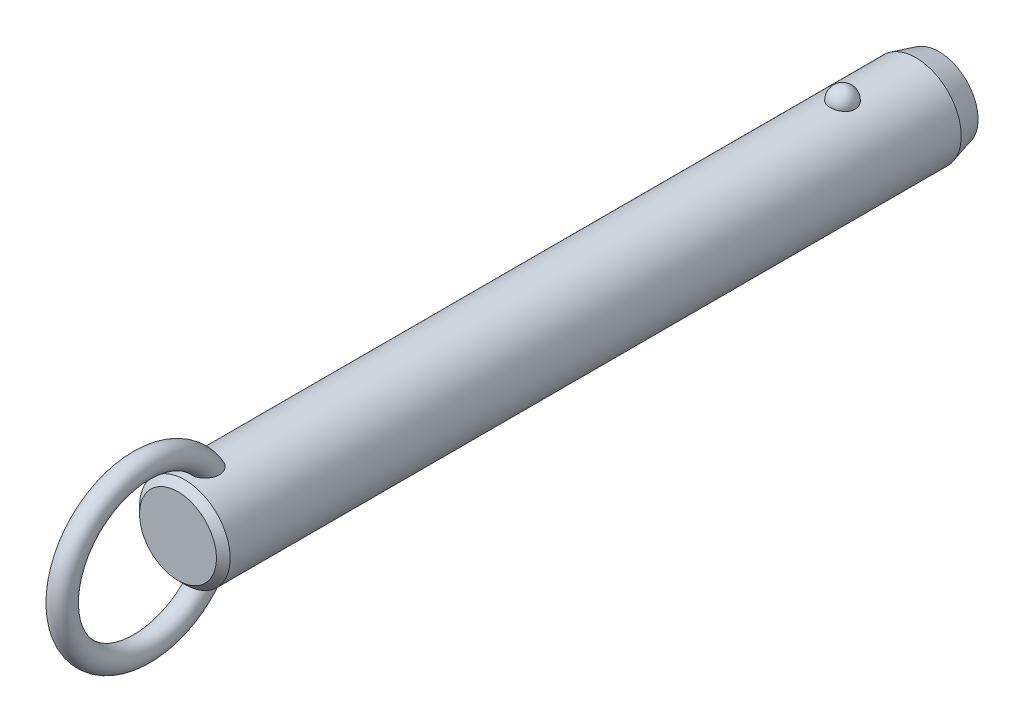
ISO-10303-21;
HEADER;
FILE_DESCRIPTION(('STEP AP214'),'2;1');
FILE_NAME('part.step','',(''),(''),'','','');
FILE_SCHEMA(('AUTOMOTIVE_DESIGN { 1 0 10303 214 1 1 1 1 }'));
ENDSEC;
DATA;
#1=APPLICATION_CONTEXT('core data for automotive mechanical design processes');
#2=APPLICATION_PROTOCOL_DEFINITION('international standard','automotive_design',2000,#1);
#3=PRODUCT_CONTEXT('',#1,'mechanical');
#4=PRODUCT('Part','Part','',(#3));
#5=PRODUCT_RELATED_PRODUCT_CATEGORY('part','',(#4));
#6=PRODUCT_DEFINITION_FORMATION('','',#4);
#7=PRODUCT_DEFINITION_CONTEXT('part definition',#1,'design');
#8=PRODUCT_DEFINITION('design','',#6,#7);
#9=PRODUCT_DEFINITION_SHAPE('','',#8);
#10=(LENGTH_UNIT() NAMED_UNIT(*) SI_UNIT(.MILLI.,.METRE.));
#11=(NAMED_UNIT(*) PLANE_ANGLE_UNIT() SI_UNIT($,.RADIAN.));
#12=(NAMED_UNIT(*) SI_UNIT($,.STERADIAN.) SOLID_ANGLE_UNIT());
#13=UNCERTAINTY_MEASURE_WITH_UNIT(LENGTH_MEASURE(1.E-05),#10,'distance_accuracy_value','');
#14=(GEOMETRIC_REPRESENTATION_CONTEXT(3) GLOBAL_UNCERTAINTY_ASSIGNED_CONTEXT((#13)) GLOBAL_UNIT_ASSIGNED_CONTEXT((#10,
#11,#12)) REPRESENTATION_CONTEXT('',''));
#15=CARTESIAN_POINT('',(0.,0.,0.));
#16=DIRECTION('',(0.,0.,1.));
#17=DIRECTION('',(1.,0.,0.));
#18=AXIS2_PLACEMENT_3D('',#15,#16,#17);
#19=CARTESIAN_POINT('',(0.,0.,104.1));
#20=DIRECTION('',(0.,0.,-1.));
#21=DIRECTION('',(-1.,0.,0.));
#22=AXIS2_PLACEMENT_3D('',#19,#20,#21);
#23=CYLINDRICAL_SURFACE('',#22,7.9);
#24=CARTESIAN_POINT('',(2.1785689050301,7.59367088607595,-2.19999999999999));
#25=CARTESIAN_POINT('',(2.17856679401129,7.59367269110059,-2.07701843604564));
#26=CARTESIAN_POINT('',(2.16853481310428,7.59657145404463,-1.95401006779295));
#27=CARTESIAN_POINT('',(2.12864689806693,7.607843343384,-1.71147811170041));
#28=CARTESIAN_POINT('',(2.09878338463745,7.61621856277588,-1.59195587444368));
#29=CARTESIAN_POINT('',(2.0199931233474,7.63749180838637,-1.3598563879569));
#30=CARTESIAN_POINT('',(1.97107475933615,7.6503878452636,-1.24727610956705));
#31=CARTESIAN_POINT('',(1.85539377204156,7.67926115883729,-1.03213234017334));
#32=CARTESIAN_POINT('',(1.78863158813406,7.69523835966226,-0.929568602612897));
#33=CARTESIAN_POINT('',(1.63856494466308,7.7285848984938,-0.736786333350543));
#34=CARTESIAN_POINT('',(1.55518140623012,7.7459606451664,-0.646630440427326));
#35=CARTESIAN_POINT('',(1.37422937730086,7.78009978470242,-0.481747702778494));
#36=CARTESIAN_POINT('',(1.27666086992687,7.79686317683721,-0.407020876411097));
#37=CARTESIAN_POINT('',(1.07024728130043,7.82786153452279,-0.275278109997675));
#38=CARTESIAN_POINT('',(0.961434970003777,7.84210353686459,-0.218212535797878));
#39=CARTESIAN_POINT('',(0.735351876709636,7.86652194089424,-0.123146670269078));
#40=CARTESIAN_POINT('',(0.618082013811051,7.87669878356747,-0.085144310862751));
#41=CARTESIAN_POINT('',(0.380637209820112,7.89170521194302,-0.0298158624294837));
#42=CARTESIAN_POINT('',(0.260550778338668,7.89662650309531,-0.0121347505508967));
#43=CARTESIAN_POINT('',(0.0190117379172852,7.90090003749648,0.00324379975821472));
#44=CARTESIAN_POINT('',(-0.102440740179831,7.90025280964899,0.00094313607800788));
#45=CARTESIAN_POINT('',(-0.341452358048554,7.89351056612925,-0.0233955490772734));
#46=CARTESIAN_POINT('',(-0.459042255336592,7.88749257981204,-0.0451545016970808));
#47=CARTESIAN_POINT('',(-0.688796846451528,7.87075812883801,-0.107408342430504));
#48=CARTESIAN_POINT('',(-0.800961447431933,7.86004158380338,-0.147903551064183));
#49=CARTESIAN_POINT('',(-1.01743634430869,7.83497131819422,-0.246799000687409));
#50=CARTESIAN_POINT('',(-1.12169791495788,7.82059709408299,-0.305300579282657));
#51=CARTESIAN_POINT('',(-1.31891765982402,7.78976470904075,-0.438549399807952));
#52=CARTESIAN_POINT('',(-1.41187469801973,7.77330633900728,-0.513298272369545));
#53=CARTESIAN_POINT('',(-1.58577142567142,7.73972434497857,-0.678622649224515));
#54=CARTESIAN_POINT('',(-1.66645140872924,7.72259402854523,-0.769470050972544));
#55=CARTESIAN_POINT('',(-1.81161503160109,7.68983776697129,-0.963538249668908));
#56=CARTESIAN_POINT('',(-1.87609753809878,7.6742119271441,-1.06675991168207));
#57=CARTESIAN_POINT('',(-1.98790138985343,7.6460202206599,-1.28401170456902));
#58=CARTESIAN_POINT('',(-2.03501994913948,7.63349104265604,-1.39815107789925));
#59=CARTESIAN_POINT('',(-2.10986724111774,7.6131449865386,-1.63301784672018));
#60=CARTESIAN_POINT('',(-2.1375965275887,7.60532797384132,-1.75374505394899));
#61=CARTESIAN_POINT('',(-2.17289256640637,7.5953195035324,-1.99782562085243));
#62=CARTESIAN_POINT('',(-2.18054294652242,7.59310471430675,-2.12116592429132));
#63=CARTESIAN_POINT('',(-2.17572919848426,7.59448538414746,-2.36741799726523));
#64=CARTESIAN_POINT('',(-2.1632656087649,7.59808068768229,-2.49032977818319));
#65=CARTESIAN_POINT('',(-2.11865035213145,7.61064035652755,-2.73161015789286));
#66=CARTESIAN_POINT('',(-2.08659579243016,7.61957823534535,-2.84999812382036));
#67=CARTESIAN_POINT('',(-2.00367799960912,7.64179982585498,-3.07955956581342));
#68=CARTESIAN_POINT('',(-1.9528140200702,7.65508371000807,-3.19073275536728));
#69=CARTESIAN_POINT('',(-1.83321113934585,7.68460381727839,-3.40337899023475));
#70=CARTESIAN_POINT('',(-1.76437735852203,7.70085556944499,-3.50479651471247));
#71=CARTESIAN_POINT('',(-1.61069526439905,7.73445734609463,-3.69446912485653));
#72=CARTESIAN_POINT('',(-1.52584634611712,7.75180741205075,-3.78272371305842));
#73=CARTESIAN_POINT('',(-1.34198059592,7.78574608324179,-3.94393987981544));
#74=CARTESIAN_POINT('',(-1.24291308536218,7.80233167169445,-4.01684434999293));
#75=CARTESIAN_POINT('',(-1.03352039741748,7.83281625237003,-4.14489386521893));
#76=CARTESIAN_POINT('',(-0.92319600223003,7.84671543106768,-4.20004014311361));
#77=CARTESIAN_POINT('',(-0.695822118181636,7.87011575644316,-4.29042017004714));
#78=CARTESIAN_POINT('',(-0.578872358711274,7.87966903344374,-4.32589112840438));
#79=CARTESIAN_POINT('',(-0.340410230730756,7.8935652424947,-4.37692226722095));
#80=CARTESIAN_POINT('',(-0.218898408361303,7.89790879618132,-4.39248482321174));
#81=CARTESIAN_POINT('',(0.0228107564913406,7.90087453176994,-4.40314405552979));
#82=CARTESIAN_POINT('',(0.142990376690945,7.89960185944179,-4.39861683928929));
#83=CARTESIAN_POINT('',(0.380829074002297,7.89171262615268,-4.37008293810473));
#84=CARTESIAN_POINT('',(0.498488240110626,7.8850962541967,-4.34607694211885));
#85=CARTESIAN_POINT('',(0.727535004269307,7.86726442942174,-4.27939317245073));
#86=CARTESIAN_POINT('',(0.838944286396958,7.85606616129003,-4.236785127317));
#87=CARTESIAN_POINT('',(1.05295421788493,7.83025654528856,-4.13408348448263));
#88=CARTESIAN_POINT('',(1.15555431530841,7.81564498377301,-4.07398879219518));
#89=CARTESIAN_POINT('',(1.35076763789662,7.7843022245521,-3.93687432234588));
#90=CARTESIAN_POINT('',(1.4432046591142,7.76754209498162,-3.85961036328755));
#91=CARTESIAN_POINT('',(1.6139111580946,7.73387857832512,-3.69076949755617));
#92=CARTESIAN_POINT('',(1.6921781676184,7.71697516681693,-3.59919010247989));
#93=CARTESIAN_POINT('',(1.83380875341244,7.6845643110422,-3.40247278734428));
#94=CARTESIAN_POINT('',(1.89689280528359,7.66908588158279,-3.29712873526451));
#95=CARTESIAN_POINT('',(2.0047823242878,7.64159441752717,-3.07707931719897));
#96=CARTESIAN_POINT('',(2.0495945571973,7.62958010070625,-2.96237743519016));
#97=CARTESIAN_POINT('',(2.11580183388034,7.61146617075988,-2.74040519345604));
#98=CARTESIAN_POINT('',(2.13929812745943,7.60484503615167,-2.63379846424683));
#99=CARTESIAN_POINT('',(2.17068242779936,7.59594664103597,-2.41813481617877));
#100=CARTESIAN_POINT('',(2.17857077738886,7.59366928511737,-2.30907795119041));
#101=CARTESIAN_POINT('',(2.1785689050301,7.59367088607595,-2.19999999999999));
#102=B_SPLINE_CURVE_WITH_KNOTS('',3,(#24,#25,#26,#27,#28,#29,#30,#31,#32,#33,#34,#35,#36,#37,
#38,#39,#40,#41,#42,#43,#44,#45,#46,#47,#48,#49,#50,#51,#52,#53,#54,#55,#56,#57,#58,#59,#60,#61,
#62,#63,#64,#65,#66,#67,#68,#69,#70,#71,#72,#73,#74,#75,#76,#77,#78,#79,#80,#81,#82,#83,#84,#85,
#86,#87,#88,#89,#90,#91,#92,#93,#94,#95,#96,#97,#98,#99,#100,#101),.UNSPECIFIED.,.T.,.F.,(4,2,2,
2,2,2,2,2,2,2,2,2,2,2,2,2,2,2,2,2,2,2,2,2,2,2,2,2,2,2,2,2,2,2,2,2,2,2,4),(0.,0.368552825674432,
0.737246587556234,1.10577831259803,1.4743009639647,1.8446206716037,2.21494081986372,
2.5842105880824,2.95344028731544,3.31611630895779,3.67875788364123,4.03628044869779,
4.39380913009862,4.75338791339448,5.11300280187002,5.47939989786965,5.8458226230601,
6.21639834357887,6.58696347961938,6.95598276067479,7.32499216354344,7.69218715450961,
8.0593967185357,8.42858578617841,8.79778880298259,9.16834203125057,9.5388695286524,
9.90482699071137,10.2707407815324,10.6298333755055,10.9889132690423,11.3466585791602,
11.7044262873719,12.0676511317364,12.4309391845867,12.8004764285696,13.1698767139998,
13.4967701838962,13.8236564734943),.UNSPECIFIED.);
#103=CARTESIAN_POINT('',(2.1785689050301,7.59367088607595,-2.19999999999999));
#104=VERTEX_POINT('',#103);
#105=EDGE_CURVE('E41',#104,#104,#102,.T.);
#106=ORIENTED_EDGE('',*,*,#105,.T.);
#107=EDGE_LOOP('',(#106));
#108=FACE_BOUND('',#107,.T.);
#109=CARTESIAN_POINT('',(0.,0.,112.42));
#110=DIRECTION('',(0.,0.,1.));
#111=DIRECTION('',(1.,0.,0.));
#112=AXIS2_PLACEMENT_3D('',#109,#110,#111);
#113=CIRCLE('',#112,7.9);
#114=CARTESIAN_POINT('',(-7.90000000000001,0.,112.42));
#115=VERTEX_POINT('',#114);
#116=EDGE_CURVE('E10',#115,#115,#113,.F.);
#117=ORIENTED_EDGE('',*,*,#116,.T.);
#118=EDGE_LOOP('',(#117));
#119=FACE_BOUND('',#118,.T.);
#120=CARTESIAN_POINT('',(-0.630969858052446,-7.87476203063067,106.312432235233));
#121=CARTESIAN_POINT('',(-0.73418033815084,-7.8664899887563,106.347285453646));
#122=CARTESIAN_POINT('',(-0.834476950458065,-7.85639291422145,106.390816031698));
#123=CARTESIAN_POINT('',(-1.02620356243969,-7.83366343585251,106.494094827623));
#124=CARTESIAN_POINT('',(-1.1176141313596,-7.82102565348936,106.553877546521));
#125=CARTESIAN_POINT('',(-1.28877277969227,-7.79464922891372,106.687839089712));
#126=CARTESIAN_POINT('',(-1.36854014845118,-7.78091246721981,106.761993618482));
#127=CARTESIAN_POINT('',(-1.5146152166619,-7.75380398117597,106.922494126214));
#128=CARTESIAN_POINT('',(-1.58092966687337,-7.74043207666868,107.008833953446));
#129=CARTESIAN_POINT('',(-1.70019064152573,-7.71512522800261,107.192978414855));
#130=CARTESIAN_POINT('',(-1.75284037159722,-7.70322473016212,107.290979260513));
#131=CARTESIAN_POINT('',(-1.84263464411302,-7.68224112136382,107.494102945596));
#132=CARTESIAN_POINT('',(-1.87977299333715,-7.6731591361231,107.599228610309));
#133=CARTESIAN_POINT('',(-1.94152728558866,-7.65777930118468,107.823284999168));
#134=CARTESIAN_POINT('',(-1.96475471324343,-7.65179654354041,107.942616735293));
#135=CARTESIAN_POINT('',(-1.99449499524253,-7.64409642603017,108.18342986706));
#136=CARTESIAN_POINT('',(-2.0010005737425,-7.64238092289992,108.304912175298));
#137=CARTESIAN_POINT('',(-1.99856014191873,-7.64302120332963,108.568340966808));
#138=CARTESIAN_POINT('',(-1.98680021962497,-7.64611845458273,108.71025654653));
#139=CARTESIAN_POINT('',(-1.94457772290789,-7.65696186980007,108.991118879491));
#140=CARTESIAN_POINT('',(-1.91409393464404,-7.66471330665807,109.130062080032));
#141=CARTESIAN_POINT('',(-1.82768670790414,-7.68582947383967,109.431939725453));
#142=CARTESIAN_POINT('',(-1.76772963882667,-7.70003779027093,109.593686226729));
#143=CARTESIAN_POINT('',(-1.65998501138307,-7.72371550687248,109.827695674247));
#144=CARTESIAN_POINT('',(-1.621079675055,-7.73200670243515,109.904297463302));
#145=CARTESIAN_POINT('',(-1.53727726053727,-7.74910377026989,110.054079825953));
#146=CARTESIAN_POINT('',(-1.49238215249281,-7.75790947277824,110.127261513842));
#147=CARTESIAN_POINT('',(-1.3739705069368,-7.77993338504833,110.30288382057));
#148=CARTESIAN_POINT('',(-1.29690364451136,-7.79328473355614,110.402955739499));
#149=CARTESIAN_POINT('',(-1.1288548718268,-7.81939266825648,110.590714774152));
#150=CARTESIAN_POINT('',(-1.03789926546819,-7.83215032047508,110.678424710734));
#151=CARTESIAN_POINT('',(-0.869532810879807,-7.85231710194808,110.813414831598));
#152=CARTESIAN_POINT('',(-0.795716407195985,-7.86021093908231,110.865076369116));
#153=CARTESIAN_POINT('',(-0.64081313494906,-7.87434920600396,110.956381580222));
#154=CARTESIAN_POINT('',(-0.55973779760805,-7.88059619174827,110.99604389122));
#155=CARTESIAN_POINT('',(-0.406456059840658,-7.88984116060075,111.054300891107));
#156=CARTESIAN_POINT('',(-0.335227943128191,-7.89321892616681,111.075384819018));
#157=CARTESIAN_POINT('',(-0.19019307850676,-7.89804235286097,111.10541418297));
#158=CARTESIAN_POINT('',(-0.11638863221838,-7.89948969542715,111.114370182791));
#159=CARTESIAN_POINT('',(0.0318414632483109,-7.90028409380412,111.119291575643));
#160=CARTESIAN_POINT('',(0.106268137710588,-7.89962640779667,111.115227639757));
#161=CARTESIAN_POINT('',(0.253290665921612,-7.8962818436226,111.094461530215));
#162=CARTESIAN_POINT('',(0.32588518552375,-7.8935935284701,111.077750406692));
#163=CARTESIAN_POINT('',(0.481441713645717,-7.88577340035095,111.028738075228));
#164=CARTESIAN_POINT('',(0.563611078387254,-7.88026321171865,110.994005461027));
#165=CARTESIAN_POINT('',(0.721129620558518,-7.86741729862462,110.911796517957));
#166=CARTESIAN_POINT('',(0.796466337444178,-7.86007832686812,110.864297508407));
#167=CARTESIAN_POINT('',(0.971456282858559,-7.84073285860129,110.736513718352));
#168=CARTESIAN_POINT('',(1.0671968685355,-7.82809461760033,110.651004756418));
#169=CARTESIAN_POINT('',(1.24418921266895,-7.80192439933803,110.466232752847));
#170=CARTESIAN_POINT('',(1.32540832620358,-7.78839049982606,110.366939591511));
#171=CARTESIAN_POINT('',(1.45199971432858,-7.76559693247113,110.189576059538));
#172=CARTESIAN_POINT('',(1.50085649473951,-7.75626094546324,110.113954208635));
#173=CARTESIAN_POINT('',(1.59197749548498,-7.7380727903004,109.958742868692));
#174=CARTESIAN_POINT('',(1.63423919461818,-7.72922080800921,109.879151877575));
#175=CARTESIAN_POINT('',(1.71222612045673,-7.71231959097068,109.716664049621));
#176=CARTESIAN_POINT('',(1.74794516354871,-7.70427111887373,109.633764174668));
#177=CARTESIAN_POINT('',(1.81270113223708,-7.68929240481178,109.465296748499));
#178=CARTESIAN_POINT('',(1.84173789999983,-7.68236218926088,109.379729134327));
#179=CARTESIAN_POINT('',(1.89322698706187,-7.6698375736,109.20528702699));
#180=CARTESIAN_POINT('',(1.91558744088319,-7.66426199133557,109.116383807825));
#181=CARTESIAN_POINT('',(1.95281367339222,-7.65485915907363,108.936969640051));
#182=CARTESIAN_POINT('',(1.96767946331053,-7.65103190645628,108.846458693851));
#183=CARTESIAN_POINT('',(2.00021456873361,-7.64262981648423,108.573732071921));
#184=CARTESIAN_POINT('',(2.00600691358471,-7.6410871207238,108.389709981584));
#185=CARTESIAN_POINT('',(1.98445334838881,-7.64669564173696,108.076501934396));
#186=CARTESIAN_POINT('',(1.96607186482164,-7.65149688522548,107.946618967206));
#187=CARTESIAN_POINT('',(1.90884967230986,-7.6659762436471,107.691632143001));
#188=CARTESIAN_POINT('',(1.8700210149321,-7.67565148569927,107.566525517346));
#189=CARTESIAN_POINT('',(1.77063986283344,-7.69918471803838,107.32454013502));
#190=CARTESIAN_POINT('',(1.70993724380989,-7.71307150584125,107.207725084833));
#191=CARTESIAN_POINT('',(1.5673307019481,-7.74330306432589,106.988144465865));
#192=CARTESIAN_POINT('',(1.48543692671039,-7.75964665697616,106.885372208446));
#193=CARTESIAN_POINT('',(1.31346177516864,-7.79047523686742,106.709380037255));
#194=CARTESIAN_POINT('',(1.22547278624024,-7.80495298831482,106.634106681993));
#195=CARTESIAN_POINT('',(1.03724352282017,-7.83218597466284,106.500486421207));
#196=CARTESIAN_POINT('',(0.937008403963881,-7.84494192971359,106.442132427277));
#197=CARTESIAN_POINT('',(0.733599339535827,-7.86649045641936,106.347027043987));
#198=CARTESIAN_POINT('',(0.630941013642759,-7.87547134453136,106.309210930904));
#199=CARTESIAN_POINT('',(0.420465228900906,-7.88950708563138,106.251116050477));
#200=CARTESIAN_POINT('',(0.312645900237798,-7.89456050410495,106.23084369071));
#201=CARTESIAN_POINT('',(0.0960869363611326,-7.9001518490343,106.208455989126));
#202=CARTESIAN_POINT('',(-0.0126341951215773,-7.90073226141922,106.206169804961));
#203=CARTESIAN_POINT('',(-0.228766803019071,-7.89742350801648,106.219367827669));
#204=CARTESIAN_POINT('',(-0.336180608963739,-7.89354403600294,106.234813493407));
#205=CARTESIAN_POINT('',(-0.473410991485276,-7.88586871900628,106.266217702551));
#206=CARTESIAN_POINT('',(-0.50525779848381,-7.88388984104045,106.274354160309));
#207=CARTESIAN_POINT('',(-0.5684812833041,-7.87958326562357,106.292208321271));
#208=CARTESIAN_POINT('',(-0.599857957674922,-7.87725556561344,106.301926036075));
#209=CARTESIAN_POINT('',(-0.630969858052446,-7.87476203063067,106.312432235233));
#210=B_SPLINE_CURVE_WITH_KNOTS('',3,(#120,#121,#122,#123,#124,#125,#126,#127,#128,#129,#130,
#131,#132,#133,#134,#135,#136,#137,#138,#139,#140,#141,#142,#143,#144,#145,#146,#147,#148,#149,
#150,#151,#152,#153,#154,#155,#156,#157,#158,#159,#160,#161,#162,#163,#164,#165,#166,#167,#168,
#169,#170,#171,#172,#173,#174,#175,#176,#177,#178,#179,#180,#181,#182,#183,#184,#185,#186,#187,
#188,#189,#190,#191,#192,#193,#194,#195,#196,#197,#198,#199,#200,#201,#202,#203,#204,#205,#206,
#207,#208,#209),.UNSPECIFIED.,.T.,.F.,(4,2,2,2,2,2,2,2,2,2,2,2,2,2,2,2,2,2,2,2,2,2,2,2,2,2,2,2,
2,2,2,2,2,2,2,2,2,2,2,2,2,2,2,2,4),(0.,0.327622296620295,0.655945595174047,0.983718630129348,
1.3113267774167,1.64554655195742,1.9798996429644,2.3436572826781,2.70757317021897,
3.13333684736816,3.55958380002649,4.07655306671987,4.3352789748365,4.59391999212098,
4.97382437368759,5.35301797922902,5.62348245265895,5.89352465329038,6.11565959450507,
6.33760092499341,6.56004255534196,6.78264174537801,7.0493084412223,7.31645206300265,
7.70130871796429,8.08701995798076,8.35824509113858,8.62957365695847,8.90115735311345,
9.17274746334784,9.44791855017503,9.72308922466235,10.2715298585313,10.6638393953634,
11.0559179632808,11.4507403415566,11.845374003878,12.1936425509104,12.5417649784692,
12.8695063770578,13.1973674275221,13.5221104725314,13.8461490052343,13.9449071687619,
14.0436660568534),.UNSPECIFIED.);
#211=CARTESIAN_POINT('',(-0.630969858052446,-7.87476203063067,106.312432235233));
#212=VERTEX_POINT('',#211);
#213=EDGE_CURVE('E58',#212,#212,#210,.T.);
#214=ORIENTED_EDGE('',*,*,#213,.T.);
#215=EDGE_LOOP('',(#214));
#216=FACE_BOUND('',#215,.T.);
#217=CARTESIAN_POINT('',(-0.630969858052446,7.87476203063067,106.312432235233));
#218=CARTESIAN_POINT('',(-0.528918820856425,7.88293636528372,106.277979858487));
#219=CARTESIAN_POINT('',(-0.423745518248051,7.8893481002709,106.251915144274));
#220=CARTESIAN_POINT('',(-0.210236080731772,7.8979273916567,106.217282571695));
#221=CARTESIAN_POINT('',(-0.10189380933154,7.90008607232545,106.208751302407));
#222=CARTESIAN_POINT('',(0.114660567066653,7.89990877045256,106.209457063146));
#223=CARTESIAN_POINT('',(0.222872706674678,7.89757640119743,106.21867980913));
#224=CARTESIAN_POINT('',(0.436107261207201,7.88867538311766,106.254652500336));
#225=CARTESIAN_POINT('',(0.541131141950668,7.8821087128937,106.28139425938));
#226=CARTESIAN_POINT('',(0.745085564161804,7.86545130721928,106.351756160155));
#227=CARTESIAN_POINT('',(0.844015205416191,7.85536005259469,106.395378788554));
#228=CARTESIAN_POINT('',(1.03299167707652,7.83275153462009,106.498379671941));
#229=CARTESIAN_POINT('',(1.12303841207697,7.8202342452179,106.557758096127));
#230=CARTESIAN_POINT('',(1.29214734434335,7.79408219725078,106.690864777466));
#231=CARTESIAN_POINT('',(1.37116907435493,7.78044359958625,106.764643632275));
#232=CARTESIAN_POINT('',(1.51597677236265,7.75353170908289,106.924235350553));
#233=CARTESIAN_POINT('',(1.58176261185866,7.74025841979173,107.010048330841));
#234=CARTESIAN_POINT('',(1.70057386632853,7.71504069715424,107.193644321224));
#235=CARTESIAN_POINT('',(1.75320073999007,7.70314257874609,107.291690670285));
#236=CARTESIAN_POINT('',(1.84293767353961,7.68216822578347,107.494893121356));
#237=CARTESIAN_POINT('',(1.88004278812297,7.67309289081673,107.600051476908));
#238=CARTESIAN_POINT('',(1.9417232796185,7.6577294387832,107.824167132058));
#239=CARTESIAN_POINT('',(1.96491037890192,7.65175648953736,107.943524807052));
#240=CARTESIAN_POINT('',(1.9945689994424,7.64407702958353,108.184384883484));
#241=CARTESIAN_POINT('',(2.00103304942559,7.64237242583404,108.30588821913));
#242=CARTESIAN_POINT('',(1.9985016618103,7.64303650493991,108.569368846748));
#243=CARTESIAN_POINT('',(1.98669038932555,7.64614714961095,108.711314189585));
#244=CARTESIAN_POINT('',(1.94436120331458,7.6570170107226,108.992228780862));
#245=CARTESIAN_POINT('',(1.91382203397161,7.66478150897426,109.131194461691));
#246=CARTESIAN_POINT('',(1.82728754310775,7.68592483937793,109.433111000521));
#247=CARTESIAN_POINT('',(1.76725778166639,7.7001468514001,109.594872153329));
#248=CARTESIAN_POINT('',(1.65939700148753,7.72384204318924,109.828891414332));
#249=CARTESIAN_POINT('',(1.62045187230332,7.73213852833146,109.905494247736));
#250=CARTESIAN_POINT('',(1.53656684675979,7.74924489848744,110.055273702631));
#251=CARTESIAN_POINT('',(1.49162892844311,7.75805461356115,110.128451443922));
#252=CARTESIAN_POINT('',(1.37317698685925,7.78007342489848,110.303952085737));
#253=CARTESIAN_POINT('',(1.29612360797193,7.79341423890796,110.403911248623));
#254=CARTESIAN_POINT('',(1.12812043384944,7.81949839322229,110.59145083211));
#255=CARTESIAN_POINT('',(1.03719688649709,7.83224280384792,110.679054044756));
#256=CARTESIAN_POINT('',(0.868871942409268,7.85239026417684,110.81389715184));
#257=CARTESIAN_POINT('',(0.795056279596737,7.86027769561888,110.865511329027));
#258=CARTESIAN_POINT('',(0.640160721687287,7.87440222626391,110.956720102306));
#259=CARTESIAN_POINT('',(0.559092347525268,7.88064188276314,110.996333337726));
#260=CARTESIAN_POINT('',(0.405820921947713,7.8898738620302,111.054505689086));
#261=CARTESIAN_POINT('',(0.334594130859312,7.89324577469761,111.075552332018));
#262=CARTESIAN_POINT('',(0.189568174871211,7.89805733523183,111.105507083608));
#263=CARTESIAN_POINT('',(0.115771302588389,7.89949866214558,111.114425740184));
#264=CARTESIAN_POINT('',(-0.0324359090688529,7.90028156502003,111.11927589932));
#265=CARTESIAN_POINT('',(-0.106847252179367,7.89961843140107,111.115178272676));
#266=CARTESIAN_POINT('',(-0.253834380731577,7.8962642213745,111.094351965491));
#267=CARTESIAN_POINT('',(-0.326408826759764,7.89357170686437,111.077614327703));
#268=CARTESIAN_POINT('',(-0.481962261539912,7.88574179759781,111.028539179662));
#269=CARTESIAN_POINT('',(-0.564145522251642,7.88022507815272,110.993763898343));
#270=CARTESIAN_POINT('',(-0.721685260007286,7.86736646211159,110.911468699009));
#271=CARTESIAN_POINT('',(-0.797029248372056,7.8600213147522,110.863926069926));
#272=CARTESIAN_POINT('',(-0.972044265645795,7.84066026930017,110.736026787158));
#273=CARTESIAN_POINT('',(-1.06779803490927,7.82801274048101,110.650443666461));
#274=CARTESIAN_POINT('',(-1.24480531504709,7.80182621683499,110.465522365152));
#275=CARTESIAN_POINT('',(-1.32602618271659,7.78828530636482,110.366154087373));
#276=CARTESIAN_POINT('',(-1.45259834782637,7.76548487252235,110.188680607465));
#277=CARTESIAN_POINT('',(-1.50143856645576,7.75614818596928,110.113025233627));
#278=CARTESIAN_POINT('',(-1.59252410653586,7.73796020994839,109.957748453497));
#279=CARTESIAN_POINT('',(-1.63476690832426,7.72910910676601,109.878125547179));
#280=CARTESIAN_POINT('',(-1.71271318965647,7.71221133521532,109.715575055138));
#281=CARTESIAN_POINT('',(-1.7484104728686,7.70416543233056,109.632644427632));
#282=CARTESIAN_POINT('',(-1.81311929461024,7.6891937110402,109.464116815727));
#283=CARTESIAN_POINT('',(-1.84213067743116,7.6822679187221,109.378519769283));
#284=CARTESIAN_POINT('',(-1.89356259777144,7.66975461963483,109.204025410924));
#285=CARTESIAN_POINT('',(-1.91589165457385,7.66418586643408,109.115099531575));
#286=CARTESIAN_POINT('',(-1.95305070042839,7.65479859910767,108.935642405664));
#287=CARTESIAN_POINT('',(-1.96788069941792,7.65098008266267,108.845111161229));
#288=CARTESIAN_POINT('',(-2.00030078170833,7.64260704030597,108.572327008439));
#289=CARTESIAN_POINT('',(-2.00600576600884,7.64108760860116,108.388271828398));
#290=CARTESIAN_POINT('',(-1.98428483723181,7.64673945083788,108.075080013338));
#291=CARTESIAN_POINT('',(-1.96583698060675,7.6515575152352,107.945240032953));
#292=CARTESIAN_POINT('',(-1.90848948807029,7.66606613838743,107.690361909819));
#293=CARTESIAN_POINT('',(-1.86960376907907,7.67575338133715,107.565320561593));
#294=CARTESIAN_POINT('',(-1.7701342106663,7.69930132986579,107.323500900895));
#295=CARTESIAN_POINT('',(-1.70940488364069,7.71318991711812,107.206784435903));
#296=CARTESIAN_POINT('',(-1.56672953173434,7.74342495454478,106.987340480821));
#297=CARTESIAN_POINT('',(-1.48478316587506,7.75977144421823,106.88461321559));
#298=CARTESIAN_POINT('',(-1.31266325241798,7.79061163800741,106.708643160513));
#299=CARTESIAN_POINT('',(-1.22456383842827,7.80509908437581,106.633358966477));
#300=CARTESIAN_POINT('',(-1.03622400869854,7.83231881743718,106.499865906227));
#301=CARTESIAN_POINT('',(-0.936015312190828,7.84505551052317,106.441613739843));
#302=CARTESIAN_POINT('',(-0.798824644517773,7.85957802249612,106.377540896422));
#303=CARTESIAN_POINT('',(-0.765787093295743,7.86286821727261,106.363224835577));
#304=CARTESIAN_POINT('',(-0.698939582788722,7.86909211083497,106.336436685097));
#305=CARTESIAN_POINT('',(-0.66512963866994,7.8720258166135,106.323964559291));
#306=CARTESIAN_POINT('',(-0.630969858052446,7.87476203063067,106.312432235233));
#307=B_SPLINE_CURVE_WITH_KNOTS('',3,(#217,#218,#219,#220,#221,#222,#223,#224,#225,#226,#227,
#228,#229,#230,#231,#232,#233,#234,#235,#236,#237,#238,#239,#240,#241,#242,#243,#244,#245,#246,
#247,#248,#249,#250,#251,#252,#253,#254,#255,#256,#257,#258,#259,#260,#261,#262,#263,#264,#265,
#266,#267,#268,#269,#270,#271,#272,#273,#274,#275,#276,#277,#278,#279,#280,#281,#282,#283,#284,
#285,#286,#287,#288,#289,#290,#291,#292,#293,#294,#295,#296,#297,#298,#299,#300,#301,#302,#303,
#304,#305,#306),.UNSPECIFIED.,.T.,.F.,(4,2,2,2,2,2,2,2,2,2,2,2,2,2,2,2,2,2,2,2,2,2,2,2,2,2,2,2,
2,2,2,2,2,2,2,2,2,2,2,2,2,2,2,2,4),(0.,0.323920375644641,0.648516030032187,0.97285063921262,
1.29703380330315,1.62126473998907,1.94549915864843,2.27089401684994,2.5962920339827,
2.93059633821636,3.26500707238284,3.62881644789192,3.99278833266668,4.41865421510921,
4.84500434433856,5.36209210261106,5.62087589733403,5.87957448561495,6.25918598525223,
6.63808782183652,6.90846748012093,7.17842501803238,7.40052350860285,7.62242871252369,
7.84483086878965,8.06739077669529,8.33414615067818,8.60137921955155,8.98641454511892,
9.3723041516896,9.64358673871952,9.91497268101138,10.1866142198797,10.4582620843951,
10.7334745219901,11.0086865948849,11.5572126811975,11.9494246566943,12.3413699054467,
12.7359755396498,13.1305875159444,13.4791770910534,13.82687259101,13.9353013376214,
14.0437279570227),.UNSPECIFIED.);
#308=CARTESIAN_POINT('',(-0.630969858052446,7.87476203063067,106.312432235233));
#309=VERTEX_POINT('',#308);
#310=EDGE_CURVE('E66',#309,#309,#307,.T.);
#311=ORIENTED_EDGE('',*,*,#310,.T.);
#312=EDGE_LOOP('',(#311));
#313=FACE_BOUND('',#312,.T.);
#314=CARTESIAN_POINT('',(0.,0.,-14.9999999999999));
#315=DIRECTION('',(0.,0.,-1.));
#316=DIRECTION('',(-1.,0.,0.));
#317=AXIS2_PLACEMENT_3D('',#314,#315,#316);
#318=CIRCLE('',#317,7.9);
#319=CARTESIAN_POINT('',(-7.9,0.,-14.9999999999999));
#320=VERTEX_POINT('',#319);
#321=EDGE_CURVE('E55',#320,#320,#318,.F.);
#322=ORIENTED_EDGE('',*,*,#321,.T.);
#323=EDGE_LOOP('',(#322));
#324=FACE_BOUND('',#323,.T.);
#325=ADVANCED_FACE('F37',(#108,#119,#216,#313,#324),#23,.T.);
#326=CARTESIAN_POINT('',(0.,0.,-19.));
#327=DIRECTION('',(0.,0.,-1.));
#328=DIRECTION('',(-1.,0.,0.));
#329=AXIS2_PLACEMENT_3D('',#326,#327,#328);
#330=PLANE('',#329);
#331=CARTESIAN_POINT('',(0.,0.,-19.));
#332=DIRECTION('',(0.,0.,-1.));
#333=DIRECTION('',(-1.,0.,0.));
#334=AXIS2_PLACEMENT_3D('',#331,#332,#333);
#335=CIRCLE('',#334,6.82820323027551);
#336=CARTESIAN_POINT('',(-6.82820323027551,0.,-19.));
#337=VERTEX_POINT('',#336);
#338=EDGE_CURVE('E65',#337,#337,#335,.T.);
#339=ORIENTED_EDGE('',*,*,#338,.T.);
#340=EDGE_LOOP('',(#339));
#341=FACE_BOUND('',#340,.T.);
#342=ADVANCED_FACE('F84',(#341),#330,.T.);
#343=CARTESIAN_POINT('',(0.,0.,-19.));
#344=DIRECTION('',(0.,0.,1.));
#345=DIRECTION('',(1.,0.,0.));
#346=AXIS2_PLACEMENT_3D('',#343,#344,#345);
#347=CONICAL_SURFACE('',#346,6.8282032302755,0.261799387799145);
#348=ORIENTED_EDGE('',*,*,#321,.F.);
#349=EDGE_LOOP('',(#348));
#350=FACE_BOUND('',#349,.T.);
#351=ORIENTED_EDGE('',*,*,#338,.F.);
#352=EDGE_LOOP('',(#351));
#353=FACE_BOUND('',#352,.T.);
#354=ADVANCED_FACE('F82',(#350,#353),#347,.T.);
#355=CARTESIAN_POINT('',(0.,0.,113.62));
#356=DIRECTION('',(0.,0.,1.));
#357=DIRECTION('',(1.,0.,0.));
#358=AXIS2_PLACEMENT_3D('',#355,#356,#357);
#359=PLANE('',#358);
#360=CARTESIAN_POINT('',(0.,0.,113.62));
#361=DIRECTION('',(0.,0.,1.));
#362=DIRECTION('',(1.,0.,0.));
#363=AXIS2_PLACEMENT_3D('',#360,#361,#362);
#364=CIRCLE('',#363,6.69999999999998);
#365=CARTESIAN_POINT('',(-6.69999999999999,0.,113.62));
#366=VERTEX_POINT('',#365);
#367=EDGE_CURVE('E50',#366,#366,#364,.T.);
#368=ORIENTED_EDGE('',*,*,#367,.T.);
#369=EDGE_LOOP('',(#368));
#370=FACE_BOUND('',#369,.T.);
#371=ADVANCED_FACE('F76',(#370),#359,.T.);
#372=CARTESIAN_POINT('',(0.,0.,119.95));
#373=DIRECTION('',(1.,0.,0.));
#374=DIRECTION('',(0.,0.,-1.));
#375=AXIS2_PLACEMENT_3D('',#372,#373,#374);
#376=TOROIDAL_SURFACE('',#375,13.85,2.);
#377=ORIENTED_EDGE('',*,*,#310,.F.);
#378=EDGE_LOOP('',(#377));
#379=FACE_BOUND('',#378,.T.);
#380=ORIENTED_EDGE('',*,*,#213,.F.);
#381=EDGE_LOOP('',(#380));
#382=FACE_BOUND('',#381,.T.);
#383=ADVANCED_FACE('F72',(#379,#382),#376,.T.);
#384=CARTESIAN_POINT('',(0.,0.,113.62));
#385=DIRECTION('',(0.,0.,-1.));
#386=DIRECTION('',(-1.,0.,0.));
#387=AXIS2_PLACEMENT_3D('',#384,#385,#386);
#388=CONICAL_SURFACE('',#387,6.69999999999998,0.785398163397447);
#389=CARTESIAN_POINT('',(-7.90000000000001,0.,112.42));
#390=CARTESIAN_POINT('',(-7.88750000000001,0.,112.4325));
#391=CARTESIAN_POINT('',(-7.87500000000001,0.,112.445));
#392=CARTESIAN_POINT('',(-7.85,0.,112.47));
#393=CARTESIAN_POINT('',(-7.8375,0.,112.4825));
#394=CARTESIAN_POINT('',(-7.81250000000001,0.,112.5075));
#395=CARTESIAN_POINT('',(-7.80000000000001,0.,112.52));
#396=CARTESIAN_POINT('',(-7.77500000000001,0.,112.545));
#397=CARTESIAN_POINT('',(-7.76250000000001,0.,112.5575));
#398=CARTESIAN_POINT('',(-7.7375,0.,112.5825));
#399=CARTESIAN_POINT('',(-7.725,0.,112.595));
#400=CARTESIAN_POINT('',(-7.7,0.,112.62));
#401=CARTESIAN_POINT('',(-7.68750000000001,0.,112.6325));
#402=CARTESIAN_POINT('',(-7.66250000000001,0.,112.6575));
#403=CARTESIAN_POINT('',(-7.65,0.,112.67));
#404=CARTESIAN_POINT('',(-7.625,0.,112.695));
#405=CARTESIAN_POINT('',(-7.6125,0.,112.7075));
#406=CARTESIAN_POINT('',(-7.5875,0.,112.7325));
#407=CARTESIAN_POINT('',(-7.575,0.,112.745));
#408=CARTESIAN_POINT('',(-7.55,0.,112.77));
#409=CARTESIAN_POINT('',(-7.5375,0.,112.7825));
#410=CARTESIAN_POINT('',(-7.5125,0.,112.8075));
#411=CARTESIAN_POINT('',(-7.5,0.,112.82));
#412=CARTESIAN_POINT('',(-7.475,0.,112.845));
#413=CARTESIAN_POINT('',(-7.4625,0.,112.8575));
#414=CARTESIAN_POINT('',(-7.4375,0.,112.8825));
#415=CARTESIAN_POINT('',(-7.425,0.,112.895));
#416=CARTESIAN_POINT('',(-7.4,0.,112.92));
#417=CARTESIAN_POINT('',(-7.3875,0.,112.9325));
#418=CARTESIAN_POINT('',(-7.3625,0.,112.9575));
#419=CARTESIAN_POINT('',(-7.35,0.,112.97));
#420=CARTESIAN_POINT('',(-7.325,0.,112.995));
#421=CARTESIAN_POINT('',(-7.3125,0.,113.0075));
#422=CARTESIAN_POINT('',(-7.2875,0.,113.0325));
#423=CARTESIAN_POINT('',(-7.275,0.,113.045));
#424=CARTESIAN_POINT('',(-7.25,0.,113.07));
#425=CARTESIAN_POINT('',(-7.2375,0.,113.0825));
#426=CARTESIAN_POINT('',(-7.2125,0.,113.1075));
#427=CARTESIAN_POINT('',(-7.2,0.,113.12));
#428=CARTESIAN_POINT('',(-7.175,0.,113.145));
#429=CARTESIAN_POINT('',(-7.1625,0.,113.1575));
#430=CARTESIAN_POINT('',(-7.1375,0.,113.1825));
#431=CARTESIAN_POINT('',(-7.125,0.,113.195));
#432=CARTESIAN_POINT('',(-7.1,0.,113.22));
#433=CARTESIAN_POINT('',(-7.0875,0.,113.2325));
#434=CARTESIAN_POINT('',(-7.06249999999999,0.,113.2575));
#435=CARTESIAN_POINT('',(-7.04999999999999,0.,113.27));
#436=CARTESIAN_POINT('',(-7.02499999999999,0.,113.295));
#437=CARTESIAN_POINT('',(-7.0125,0.,113.3075));
#438=CARTESIAN_POINT('',(-6.9875,0.,113.3325));
#439=CARTESIAN_POINT('',(-6.975,0.,113.345));
#440=CARTESIAN_POINT('',(-6.94999999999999,0.,113.37));
#441=CARTESIAN_POINT('',(-6.93749999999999,0.,113.3825));
#442=CARTESIAN_POINT('',(-6.91249999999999,0.,113.4075));
#443=CARTESIAN_POINT('',(-6.9,0.,113.42));
#444=CARTESIAN_POINT('',(-6.87499999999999,0.,113.445));
#445=CARTESIAN_POINT('',(-6.86249999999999,0.,113.4575));
#446=CARTESIAN_POINT('',(-6.83749999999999,0.,113.4825));
#447=CARTESIAN_POINT('',(-6.82499999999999,0.,113.495));
#448=CARTESIAN_POINT('',(-6.79999999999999,0.,113.52));
#449=CARTESIAN_POINT('',(-6.78749999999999,0.,113.5325));
#450=CARTESIAN_POINT('',(-6.76249999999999,0.,113.5575));
#451=CARTESIAN_POINT('',(-6.74999999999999,0.,113.57));
#452=CARTESIAN_POINT('',(-6.72499999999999,0.,113.595));
#453=CARTESIAN_POINT('',(-6.71249999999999,0.,113.6075));
#454=CARTESIAN_POINT('',(-6.69999999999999,0.,113.62));
#455=B_SPLINE_CURVE_WITH_KNOTS('',3,(#389,#390,#391,#392,#393,#394,#395,#396,#397,#398,#399,
#400,#401,#402,#403,#404,#405,#406,#407,#408,#409,#410,#411,#412,#413,#414,#415,#416,#417,#418,
#419,#420,#421,#422,#423,#424,#425,#426,#427,#428,#429,#430,#431,#432,#433,#434,#435,#436,#437,
#438,#439,#440,#441,#442,#443,#444,#445,#446,#447,#448,#449,#450,#451,#452,#453,#454),
.UNSPECIFIED.,.F.,.F.,(4,2,2,2,2,2,2,2,2,2,2,2,2,2,2,2,2,2,2,2,2,2,2,2,2,2,2,2,2,2,2,2,4),(0.,
0.0530330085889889,0.106066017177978,0.159099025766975,0.212132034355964,0.265165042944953,
0.318198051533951,0.37123106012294,0.424264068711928,0.477297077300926,0.530330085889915,
0.583363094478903,0.636396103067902,0.68942911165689,0.742462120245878,0.795495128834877,
0.848528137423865,0.901561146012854,0.954594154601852,1.00762716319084,1.06066017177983,
1.11369318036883,1.16672618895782,1.2197591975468,1.2727922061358,1.32582521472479,
1.37885822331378,1.43189123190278,1.48492424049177,1.53795724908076,1.59099025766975,
1.64402326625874,1.69705627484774),.UNSPECIFIED.);
#456=EDGE_CURVE('BSEAM39',#115,#366,#455,.T.);
#457=ORIENTED_EDGE('',*,*,#116,.F.);
#458=ORIENTED_EDGE('',*,*,#367,.F.);
#459=ORIENTED_EDGE('',*,*,#456,.T.);
#460=ORIENTED_EDGE('',*,*,#456,.F.);
#461=EDGE_LOOP('',(#457,#459,#458,#460));
#462=FACE_BOUND('',#461,.T.);
#463=ADVANCED_FACE('F39',(#462),#388,.T.);
#464=CARTESIAN_POINT('',(0.,7.9,-2.19999999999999));
#465=DIRECTION('',(0.,1.,0.));
#466=DIRECTION('',(0.,0.,-1.));
#467=AXIS2_PLACEMENT_3D('',#464,#465,#466);
#468=SPHERICAL_SURFACE('',#467,2.2);
#469=ORIENTED_EDGE('',*,*,#105,.F.);
#470=EDGE_LOOP('',(#469));
#471=FACE_BOUND('',#470,.T.);
#472=ADVANCED_FACE('F78',(#471),#468,.T.);
#473=CLOSED_SHELL('',(#325,#342,#354,#371,#383,#463,#472));
#474=MANIFOLD_SOLID_BREP('B2',#473);
#475=ADVANCED_BREP_SHAPE_REPRESENTATION('',(#18,#474),#14);
#476=SHAPE_DEFINITION_REPRESENTATION(#9,#475);
ENDSEC;
END-ISO-10303-21;
